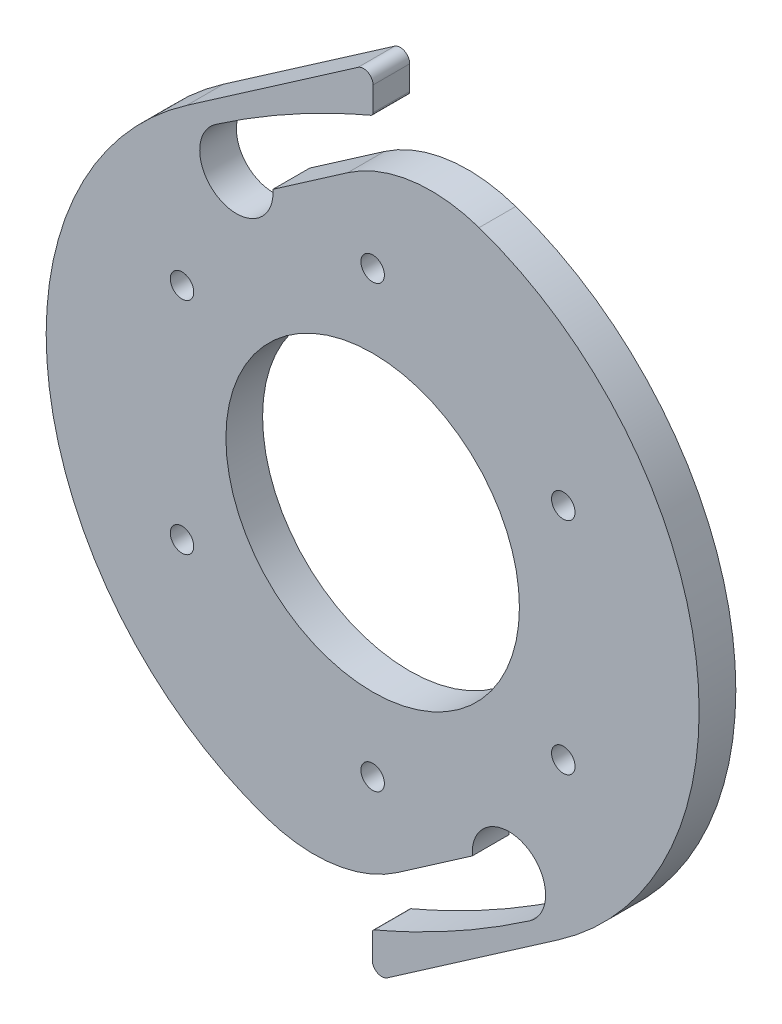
from build123d import *

# Parameters (mm, degrees)
ESQUISSE3_R        = 20
ESQUISSE3_R_2      = 1.6
BOSS_EXTRU_1_DEPTH = 5


with BuildPart() as part:
    # Esquisse3 → Boss.-Extru.1 (new body)
    with BuildSketch(Plane.XY):
        with BuildLine():
            Line((-25.326930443, 36.581030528), (-1.989027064, 52.739062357))
            ThreePointArc((-1.989027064, 52.739062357), (-0.645700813, 52.821756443), (0.050977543, 51.670234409))
            Line((0.050977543, 51.670234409), (0.050977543, 48.400828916))
            ThreePointArc((0.050977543, 48.400828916), (-0.031833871, 48.125231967), (-0.25283719, 47.940925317))
            add(Edge.make_bspline(
                [(-21.413249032, 36.289385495), (-14.702781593, 40.901897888), (-7.649310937, 44.785744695), (-0.25283719, 47.940925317)],
                knots=[0, 0, 0, 0, 0.807146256, 0.807146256, 0.807146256, 0.807146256], degree=3))
            ThreePointArc((-21.413249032, 36.289385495), (-20.721056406, 27.666261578), (-13.58093673, 32.550530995))
            Line((-13.58093673, 32.550530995), (-3.400848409, 39.59873016))
            ThreePointArc((-3.400848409, 39.59873016), (5.256931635, 42.968450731), (14.503124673, 42.062864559))
            ThreePointArc((14.503124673, 42.062864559), (36.227837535, 25.829614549), (44.492979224, 0))
            ThreePointArc((44.492979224, 0), (39.411266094, -20.648905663), (25.326930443, -36.581030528))
            Line((25.326930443, -36.581030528), (1.989027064, -52.739062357))
            ThreePointArc((1.989027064, -52.739062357), (0.645700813, -52.821756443), (-0.050977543, -51.670234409))
            Line((-0.050977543, -51.670234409), (-0.050977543, -48.400828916))
            ThreePointArc((-0.050977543, -48.400828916), (0.031833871, -48.125231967), (0.25283719, -47.940925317))
            add(Edge.make_bspline(
                [(21.413249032, -36.289385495), (14.702781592, -40.901897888), (7.649310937, -44.785744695), (0.25283719, -47.940925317)],
                knots=[0, 0, 0, 0, 0.807146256, 0.807146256, 0.807146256, 0.807146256], degree=3))
            ThreePointArc((21.413249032, -36.289385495), (20.721056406, -27.666261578), (13.58093673, -32.550530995))
            Line((13.58093673, -32.550530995), (3.400848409, -39.59873016))
            ThreePointArc((3.400848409, -39.59873016), (-5.256931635, -42.968450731), (-14.503124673, -42.062864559))
            ThreePointArc((-14.503124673, -42.062864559), (-36.227837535, -25.829614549), (-44.492979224, 0))
            ThreePointArc((-44.492979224, 0), (-39.411266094, 20.648905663), (-25.326930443, 36.581030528))
        make_face()
        Circle(ESQUISSE3_R, mode=Mode.SUBTRACT)
        with Locations((0, 30)):
            Circle(ESQUISSE3_R_2, mode=Mode.SUBTRACT)
        with Locations((25.980762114, 15)):
            Circle(ESQUISSE3_R_2, mode=Mode.SUBTRACT)
        with Locations((25.980762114, -15)):
            Circle(ESQUISSE3_R_2, mode=Mode.SUBTRACT)
        with Locations((0, -30)):
            Circle(ESQUISSE3_R_2, mode=Mode.SUBTRACT)
        with Locations((-25.980762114, -15)):
            Circle(ESQUISSE3_R_2, mode=Mode.SUBTRACT)
        with Locations((-25.980762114, 15)):
            Circle(ESQUISSE3_R_2, mode=Mode.SUBTRACT)
    extrude(amount=BOSS_EXTRU_1_DEPTH)


solid = part.part
